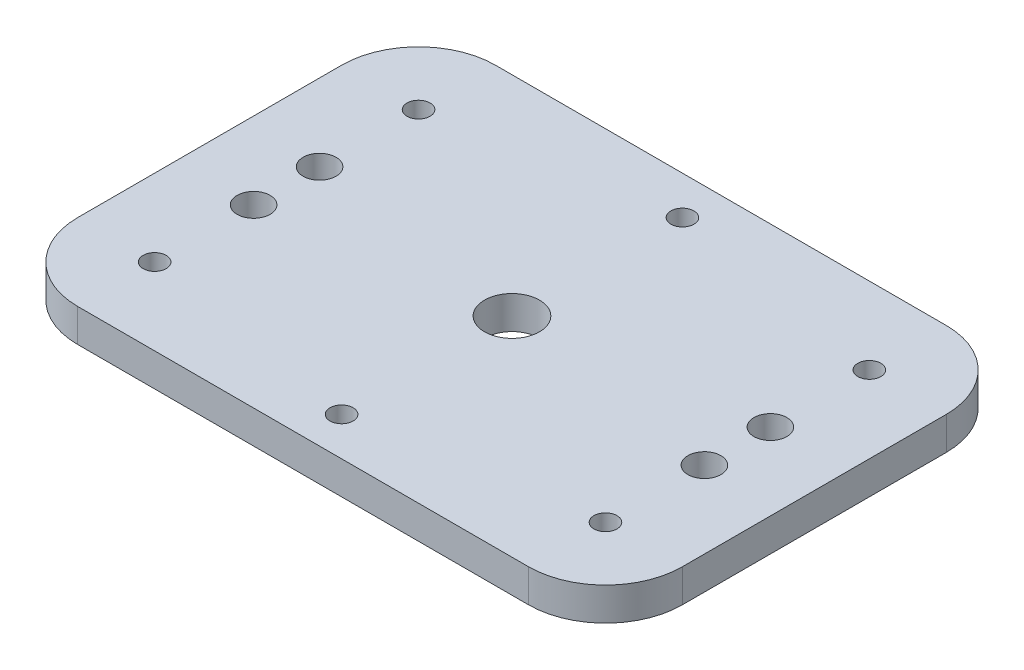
ISO-10303-21;
HEADER;
FILE_DESCRIPTION(('STEP AP214'),'2;1');
FILE_NAME('part.step','',(''),(''),'','','');
FILE_SCHEMA(('AUTOMOTIVE_DESIGN { 1 0 10303 214 1 1 1 1 }'));
ENDSEC;
DATA;
#1=APPLICATION_CONTEXT('core data for automotive mechanical design processes');
#2=APPLICATION_PROTOCOL_DEFINITION('international standard','automotive_design',2000,#1);
#3=PRODUCT_CONTEXT('',#1,'mechanical');
#4=PRODUCT('Part','Part','',(#3));
#5=PRODUCT_RELATED_PRODUCT_CATEGORY('part','',(#4));
#6=PRODUCT_DEFINITION_FORMATION('','',#4);
#7=PRODUCT_DEFINITION_CONTEXT('part definition',#1,'design');
#8=PRODUCT_DEFINITION('design','',#6,#7);
#9=PRODUCT_DEFINITION_SHAPE('','',#8);
#10=(LENGTH_UNIT() NAMED_UNIT(*) SI_UNIT(.MILLI.,.METRE.));
#11=(NAMED_UNIT(*) PLANE_ANGLE_UNIT() SI_UNIT($,.RADIAN.));
#12=(NAMED_UNIT(*) SI_UNIT($,.STERADIAN.) SOLID_ANGLE_UNIT());
#13=UNCERTAINTY_MEASURE_WITH_UNIT(LENGTH_MEASURE(1.E-05),#10,'distance_accuracy_value','');
#14=(GEOMETRIC_REPRESENTATION_CONTEXT(3) GLOBAL_UNCERTAINTY_ASSIGNED_CONTEXT((#13)) GLOBAL_UNIT_ASSIGNED_CONTEXT((#10,
#11,#12)) REPRESENTATION_CONTEXT('',''));
#15=CARTESIAN_POINT('',(0.,0.,0.));
#16=DIRECTION('',(0.,0.,1.));
#17=DIRECTION('',(1.,0.,0.));
#18=AXIS2_PLACEMENT_3D('',#15,#16,#17);
#19=CARTESIAN_POINT('',(96.,6.,-62.));
#20=DIRECTION('',(0.,1.,0.));
#21=DIRECTION('',(0.,0.,1.));
#22=AXIS2_PLACEMENT_3D('',#19,#20,#21);
#23=PLANE('',#22);
#24=CARTESIAN_POINT('',(14.,6.,-62.));
#25=DIRECTION('',(0.,1.,0.));
#26=DIRECTION('',(0.,0.,1.));
#27=AXIS2_PLACEMENT_3D('',#24,#25,#26);
#28=CIRCLE('',#27,2.09999999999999);
#29=CARTESIAN_POINT('',(14.,6.,-59.9));
#30=VERTEX_POINT('',#29);
#31=EDGE_CURVE('E239',#30,#30,#28,.T.);
#32=ORIENTED_EDGE('',*,*,#31,.F.);
#33=EDGE_LOOP('',(#32));
#34=FACE_BOUND('',#33,.T.);
#35=CARTESIAN_POINT('',(55.,6.,-69.));
#36=DIRECTION('',(0.,1.,0.));
#37=DIRECTION('',(0.,0.,1.));
#38=AXIS2_PLACEMENT_3D('',#35,#36,#37);
#39=CIRCLE('',#38,2.09999999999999);
#40=CARTESIAN_POINT('',(55.,6.,-66.9));
#41=VERTEX_POINT('',#40);
#42=EDGE_CURVE('E233',#41,#41,#39,.T.);
#43=ORIENTED_EDGE('',*,*,#42,.F.);
#44=EDGE_LOOP('',(#43));
#45=FACE_BOUND('',#44,.T.);
#46=CARTESIAN_POINT('',(96.,6.,-62.));
#47=DIRECTION('',(0.,1.,0.));
#48=DIRECTION('',(0.,0.,1.));
#49=AXIS2_PLACEMENT_3D('',#46,#47,#48);
#50=CIRCLE('',#49,2.09999999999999);
#51=CARTESIAN_POINT('',(96.,6.,-59.9));
#52=VERTEX_POINT('',#51);
#53=EDGE_CURVE('E227',#52,#52,#50,.T.);
#54=ORIENTED_EDGE('',*,*,#53,.F.);
#55=EDGE_LOOP('',(#54));
#56=FACE_BOUND('',#55,.T.);
#57=CARTESIAN_POINT('',(96.,6.,-14.));
#58=DIRECTION('',(0.,1.,0.));
#59=DIRECTION('',(0.,0.,1.));
#60=AXIS2_PLACEMENT_3D('',#57,#58,#59);
#61=CIRCLE('',#60,2.09999999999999);
#62=CARTESIAN_POINT('',(96.,6.,-11.9));
#63=VERTEX_POINT('',#62);
#64=EDGE_CURVE('E221',#63,#63,#61,.T.);
#65=ORIENTED_EDGE('',*,*,#64,.F.);
#66=EDGE_LOOP('',(#65));
#67=FACE_BOUND('',#66,.T.);
#68=CARTESIAN_POINT('',(55.,6.,-7.));
#69=DIRECTION('',(0.,1.,0.));
#70=DIRECTION('',(0.,0.,1.));
#71=AXIS2_PLACEMENT_3D('',#68,#69,#70);
#72=CIRCLE('',#71,2.09999999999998);
#73=CARTESIAN_POINT('',(55.,6.,-4.90000000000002));
#74=VERTEX_POINT('',#73);
#75=EDGE_CURVE('E215',#74,#74,#72,.T.);
#76=ORIENTED_EDGE('',*,*,#75,.F.);
#77=EDGE_LOOP('',(#76));
#78=FACE_BOUND('',#77,.T.);
#79=CARTESIAN_POINT('',(14.,6.,-14.));
#80=DIRECTION('',(0.,1.,0.));
#81=DIRECTION('',(0.,0.,1.));
#82=AXIS2_PLACEMENT_3D('',#79,#80,#81);
#83=CIRCLE('',#82,2.09999999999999);
#84=CARTESIAN_POINT('',(14.,6.,-11.9));
#85=VERTEX_POINT('',#84);
#86=EDGE_CURVE('E209',#85,#85,#83,.T.);
#87=ORIENTED_EDGE('',*,*,#86,.F.);
#88=EDGE_LOOP('',(#87));
#89=FACE_BOUND('',#88,.T.);
#90=CARTESIAN_POINT('',(96.,6.,-44.));
#91=DIRECTION('',(0.,1.,0.));
#92=DIRECTION('',(0.,0.,1.));
#93=AXIS2_PLACEMENT_3D('',#90,#91,#92);
#94=CIRCLE('',#93,3.00000000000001);
#95=CARTESIAN_POINT('',(96.,6.,-41.));
#96=VERTEX_POINT('',#95);
#97=EDGE_CURVE('E192',#96,#96,#94,.T.);
#98=ORIENTED_EDGE('',*,*,#97,.F.);
#99=EDGE_LOOP('',(#98));
#100=FACE_BOUND('',#99,.T.);
#101=CARTESIAN_POINT('',(14.,6.,-44.));
#102=DIRECTION('',(0.,1.,0.));
#103=DIRECTION('',(0.,0.,1.));
#104=AXIS2_PLACEMENT_3D('',#101,#102,#103);
#105=CIRCLE('',#104,3.);
#106=CARTESIAN_POINT('',(14.,6.,-41.));
#107=VERTEX_POINT('',#106);
#108=EDGE_CURVE('E180',#107,#107,#105,.T.);
#109=ORIENTED_EDGE('',*,*,#108,.F.);
#110=EDGE_LOOP('',(#109));
#111=FACE_BOUND('',#110,.T.);
#112=CARTESIAN_POINT('',(96.,6.,-62.));
#113=DIRECTION('',(0.,1.,0.));
#114=DIRECTION('',(0.,0.,1.));
#115=AXIS2_PLACEMENT_3D('',#112,#113,#114);
#116=CIRCLE('',#115,14.);
#117=CARTESIAN_POINT('',(110.,6.,-62.));
#118=VERTEX_POINT('',#117);
#119=CARTESIAN_POINT('',(96.,6.,-76.));
#120=VERTEX_POINT('',#119);
#121=EDGE_CURVE('E143',#118,#120,#116,.T.);
#122=ORIENTED_EDGE('',*,*,#121,.T.);
#123=DIRECTION('',(-1.,0.,0.));
#124=VECTOR('',#123,1.);
#125=CARTESIAN_POINT('',(14.,6.,-76.));
#126=LINE('',#125,#124);
#127=CARTESIAN_POINT('',(14.,6.,-76.));
#128=VERTEX_POINT('',#127);
#129=EDGE_CURVE('E91',#120,#128,#126,.T.);
#130=ORIENTED_EDGE('',*,*,#129,.T.);
#131=CARTESIAN_POINT('',(14.,6.,-62.));
#132=DIRECTION('',(0.,1.,0.));
#133=DIRECTION('',(0.,0.,-1.));
#134=AXIS2_PLACEMENT_3D('',#131,#132,#133);
#135=CIRCLE('',#134,14.);
#136=CARTESIAN_POINT('',(0.,6.,-62.));
#137=VERTEX_POINT('',#136);
#138=EDGE_CURVE('E158',#128,#137,#135,.T.);
#139=ORIENTED_EDGE('',*,*,#138,.T.);
#140=DIRECTION('',(0.,0.,1.));
#141=VECTOR('',#140,1.);
#142=CARTESIAN_POINT('',(0.,6.,-14.));
#143=LINE('',#142,#141);
#144=CARTESIAN_POINT('',(0.,6.,-14.));
#145=VERTEX_POINT('',#144);
#146=EDGE_CURVE('E171',#137,#145,#143,.T.);
#147=ORIENTED_EDGE('',*,*,#146,.T.);
#148=CARTESIAN_POINT('',(14.,6.,-14.));
#149=DIRECTION('',(0.,1.,0.));
#150=DIRECTION('',(0.,0.,1.));
#151=AXIS2_PLACEMENT_3D('',#148,#149,#150);
#152=CIRCLE('',#151,14.);
#153=CARTESIAN_POINT('',(14.,6.,0.));
#154=VERTEX_POINT('',#153);
#155=EDGE_CURVE('E110',#145,#154,#152,.T.);
#156=ORIENTED_EDGE('',*,*,#155,.T.);
#157=DIRECTION('',(1.,0.,0.));
#158=VECTOR('',#157,1.);
#159=CARTESIAN_POINT('',(14.,6.,0.));
#160=LINE('',#159,#158);
#161=CARTESIAN_POINT('',(96.,6.,0.));
#162=VERTEX_POINT('',#161);
#163=EDGE_CURVE('E104',#154,#162,#160,.T.);
#164=ORIENTED_EDGE('',*,*,#163,.T.);
#165=CARTESIAN_POINT('',(96.,6.,-14.));
#166=DIRECTION('',(0.,1.,0.));
#167=DIRECTION('',(0.,0.,1.));
#168=AXIS2_PLACEMENT_3D('',#165,#166,#167);
#169=CIRCLE('',#168,14.);
#170=CARTESIAN_POINT('',(110.,6.,-14.));
#171=VERTEX_POINT('',#170);
#172=EDGE_CURVE('E108',#162,#171,#169,.T.);
#173=ORIENTED_EDGE('',*,*,#172,.T.);
#174=DIRECTION('',(0.,0.,-1.));
#175=VECTOR('',#174,1.);
#176=CARTESIAN_POINT('',(110.,6.,-14.));
#177=LINE('',#176,#175);
#178=EDGE_CURVE('E48',#171,#118,#177,.T.);
#179=ORIENTED_EDGE('',*,*,#178,.T.);
#180=EDGE_LOOP('',(#122,#130,#139,#147,#156,#164,#173,#179));
#181=FACE_BOUND('',#180,.T.);
#182=CARTESIAN_POINT('',(55.,6.,-38.));
#183=DIRECTION('',(0.,1.,0.));
#184=DIRECTION('',(0.,0.,1.));
#185=AXIS2_PLACEMENT_3D('',#182,#183,#184);
#186=CIRCLE('',#185,5.);
#187=CARTESIAN_POINT('',(55.,6.,-33.));
#188=VERTEX_POINT('',#187);
#189=EDGE_CURVE('E132',#188,#188,#186,.T.);
#190=ORIENTED_EDGE('',*,*,#189,.F.);
#191=EDGE_LOOP('',(#190));
#192=FACE_BOUND('',#191,.T.);
#193=CARTESIAN_POINT('',(14.,6.,-32.));
#194=DIRECTION('',(0.,1.,0.));
#195=DIRECTION('',(0.,0.,1.));
#196=AXIS2_PLACEMENT_3D('',#193,#194,#195);
#197=CIRCLE('',#196,3.);
#198=CARTESIAN_POINT('',(14.,6.,-29.));
#199=VERTEX_POINT('',#198);
#200=EDGE_CURVE('E186',#199,#199,#197,.T.);
#201=ORIENTED_EDGE('',*,*,#200,.F.);
#202=EDGE_LOOP('',(#201));
#203=FACE_BOUND('',#202,.T.);
#204=CARTESIAN_POINT('',(96.,6.,-32.));
#205=DIRECTION('',(0.,1.,0.));
#206=DIRECTION('',(0.,0.,1.));
#207=AXIS2_PLACEMENT_3D('',#204,#205,#206);
#208=CIRCLE('',#207,3.00000000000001);
#209=CARTESIAN_POINT('',(96.,6.,-29.));
#210=VERTEX_POINT('',#209);
#211=EDGE_CURVE('E198',#210,#210,#208,.T.);
#212=ORIENTED_EDGE('',*,*,#211,.F.);
#213=EDGE_LOOP('',(#212));
#214=FACE_BOUND('',#213,.T.);
#215=ADVANCED_FACE('F31',(#34,#45,#56,#67,#78,#89,#100,#111,#181,#192,#203,#214),#23,.T.);
#216=CARTESIAN_POINT('',(96.,0.,-62.));
#217=DIRECTION('',(0.,1.,0.));
#218=DIRECTION('',(0.,0.,1.));
#219=AXIS2_PLACEMENT_3D('',#216,#217,#218);
#220=PLANE('',#219);
#221=CARTESIAN_POINT('',(14.,0.,-62.));
#222=DIRECTION('',(0.,1.,0.));
#223=DIRECTION('',(0.,0.,1.));
#224=AXIS2_PLACEMENT_3D('',#221,#222,#223);
#225=CIRCLE('',#224,2.1);
#226=CARTESIAN_POINT('',(14.,0.,-59.9));
#227=VERTEX_POINT('',#226);
#228=EDGE_CURVE('E236',#227,#227,#225,.T.);
#229=ORIENTED_EDGE('',*,*,#228,.T.);
#230=EDGE_LOOP('',(#229));
#231=FACE_BOUND('',#230,.T.);
#232=CARTESIAN_POINT('',(55.,0.,-69.));
#233=DIRECTION('',(0.,1.,0.));
#234=DIRECTION('',(0.,0.,1.));
#235=AXIS2_PLACEMENT_3D('',#232,#233,#234);
#236=CIRCLE('',#235,2.1);
#237=CARTESIAN_POINT('',(55.,0.,-66.9));
#238=VERTEX_POINT('',#237);
#239=EDGE_CURVE('E230',#238,#238,#236,.T.);
#240=ORIENTED_EDGE('',*,*,#239,.T.);
#241=EDGE_LOOP('',(#240));
#242=FACE_BOUND('',#241,.T.);
#243=CARTESIAN_POINT('',(96.,0.,-62.));
#244=DIRECTION('',(0.,1.,0.));
#245=DIRECTION('',(0.,0.,1.));
#246=AXIS2_PLACEMENT_3D('',#243,#244,#245);
#247=CIRCLE('',#246,2.1);
#248=CARTESIAN_POINT('',(96.,0.,-59.9));
#249=VERTEX_POINT('',#248);
#250=EDGE_CURVE('E224',#249,#249,#247,.T.);
#251=ORIENTED_EDGE('',*,*,#250,.T.);
#252=EDGE_LOOP('',(#251));
#253=FACE_BOUND('',#252,.T.);
#254=CARTESIAN_POINT('',(96.,0.,-14.));
#255=DIRECTION('',(0.,1.,0.));
#256=DIRECTION('',(0.,0.,1.));
#257=AXIS2_PLACEMENT_3D('',#254,#255,#256);
#258=CIRCLE('',#257,2.1);
#259=CARTESIAN_POINT('',(96.,0.,-11.9));
#260=VERTEX_POINT('',#259);
#261=EDGE_CURVE('E218',#260,#260,#258,.T.);
#262=ORIENTED_EDGE('',*,*,#261,.T.);
#263=EDGE_LOOP('',(#262));
#264=FACE_BOUND('',#263,.T.);
#265=CARTESIAN_POINT('',(55.,0.,-7.));
#266=DIRECTION('',(0.,1.,0.));
#267=DIRECTION('',(0.,0.,1.));
#268=AXIS2_PLACEMENT_3D('',#265,#266,#267);
#269=CIRCLE('',#268,2.1);
#270=CARTESIAN_POINT('',(55.,0.,-4.9));
#271=VERTEX_POINT('',#270);
#272=EDGE_CURVE('E212',#271,#271,#269,.T.);
#273=ORIENTED_EDGE('',*,*,#272,.T.);
#274=EDGE_LOOP('',(#273));
#275=FACE_BOUND('',#274,.T.);
#276=CARTESIAN_POINT('',(14.,0.,-14.));
#277=DIRECTION('',(0.,1.,0.));
#278=DIRECTION('',(0.,0.,1.));
#279=AXIS2_PLACEMENT_3D('',#276,#277,#278);
#280=CIRCLE('',#279,2.1);
#281=CARTESIAN_POINT('',(14.,0.,-11.9));
#282=VERTEX_POINT('',#281);
#283=EDGE_CURVE('E204',#282,#282,#280,.T.);
#284=ORIENTED_EDGE('',*,*,#283,.T.);
#285=EDGE_LOOP('',(#284));
#286=FACE_BOUND('',#285,.T.);
#287=CARTESIAN_POINT('',(96.,0.,-44.));
#288=DIRECTION('',(0.,1.,0.));
#289=DIRECTION('',(0.,0.,1.));
#290=AXIS2_PLACEMENT_3D('',#287,#288,#289);
#291=CIRCLE('',#290,3.00000000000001);
#292=CARTESIAN_POINT('',(96.,0.,-41.));
#293=VERTEX_POINT('',#292);
#294=EDGE_CURVE('E195',#293,#293,#291,.T.);
#295=ORIENTED_EDGE('',*,*,#294,.T.);
#296=EDGE_LOOP('',(#295));
#297=FACE_BOUND('',#296,.T.);
#298=CARTESIAN_POINT('',(14.,0.,-44.));
#299=DIRECTION('',(0.,1.,0.));
#300=DIRECTION('',(0.,0.,1.));
#301=AXIS2_PLACEMENT_3D('',#298,#299,#300);
#302=CIRCLE('',#301,3.);
#303=CARTESIAN_POINT('',(14.,0.,-41.));
#304=VERTEX_POINT('',#303);
#305=EDGE_CURVE('E183',#304,#304,#302,.T.);
#306=ORIENTED_EDGE('',*,*,#305,.T.);
#307=EDGE_LOOP('',(#306));
#308=FACE_BOUND('',#307,.T.);
#309=CARTESIAN_POINT('',(96.,0.,-62.));
#310=DIRECTION('',(0.,1.,0.));
#311=DIRECTION('',(0.,0.,1.));
#312=AXIS2_PLACEMENT_3D('',#309,#310,#311);
#313=CIRCLE('',#312,14.);
#314=CARTESIAN_POINT('',(110.,0.,-62.));
#315=VERTEX_POINT('',#314);
#316=CARTESIAN_POINT('',(96.,0.,-76.));
#317=VERTEX_POINT('',#316);
#318=EDGE_CURVE('E128',#315,#317,#313,.T.);
#319=ORIENTED_EDGE('',*,*,#318,.F.);
#320=DIRECTION('',(0.,0.,-1.));
#321=VECTOR('',#320,1.);
#322=CARTESIAN_POINT('',(110.,0.,-14.));
#323=LINE('',#322,#321);
#324=CARTESIAN_POINT('',(110.,0.,-14.));
#325=VERTEX_POINT('',#324);
#326=EDGE_CURVE('E83',#325,#315,#323,.T.);
#327=ORIENTED_EDGE('',*,*,#326,.F.);
#328=CARTESIAN_POINT('',(96.,0.,-14.));
#329=DIRECTION('',(0.,1.,0.));
#330=DIRECTION('',(0.,0.,1.));
#331=AXIS2_PLACEMENT_3D('',#328,#329,#330);
#332=CIRCLE('',#331,14.);
#333=CARTESIAN_POINT('',(96.,0.,0.));
#334=VERTEX_POINT('',#333);
#335=EDGE_CURVE('E77',#334,#325,#332,.T.);
#336=ORIENTED_EDGE('',*,*,#335,.F.);
#337=DIRECTION('',(1.,0.,0.));
#338=VECTOR('',#337,1.);
#339=CARTESIAN_POINT('',(14.,0.,0.));
#340=LINE('',#339,#338);
#341=CARTESIAN_POINT('',(14.,0.,0.));
#342=VERTEX_POINT('',#341);
#343=EDGE_CURVE('E118',#342,#334,#340,.T.);
#344=ORIENTED_EDGE('',*,*,#343,.F.);
#345=CARTESIAN_POINT('',(14.,0.,-14.));
#346=DIRECTION('',(0.,1.,0.));
#347=DIRECTION('',(0.,0.,1.));
#348=AXIS2_PLACEMENT_3D('',#345,#346,#347);
#349=CIRCLE('',#348,14.);
#350=CARTESIAN_POINT('',(0.,0.,-14.));
#351=VERTEX_POINT('',#350);
#352=EDGE_CURVE('E138',#351,#342,#349,.T.);
#353=ORIENTED_EDGE('',*,*,#352,.F.);
#354=DIRECTION('',(0.,0.,1.));
#355=VECTOR('',#354,1.);
#356=CARTESIAN_POINT('',(0.,0.,-14.));
#357=LINE('',#356,#355);
#358=CARTESIAN_POINT('',(0.,0.,-62.));
#359=VERTEX_POINT('',#358);
#360=EDGE_CURVE('E136',#359,#351,#357,.T.);
#361=ORIENTED_EDGE('',*,*,#360,.F.);
#362=CARTESIAN_POINT('',(14.,0.,-62.));
#363=DIRECTION('',(0.,1.,0.));
#364=DIRECTION('',(0.,0.,-1.));
#365=AXIS2_PLACEMENT_3D('',#362,#363,#364);
#366=CIRCLE('',#365,14.);
#367=CARTESIAN_POINT('',(14.,0.,-76.));
#368=VERTEX_POINT('',#367);
#369=EDGE_CURVE('E134',#368,#359,#366,.T.);
#370=ORIENTED_EDGE('',*,*,#369,.F.);
#371=DIRECTION('',(-1.,0.,0.));
#372=VECTOR('',#371,1.);
#373=CARTESIAN_POINT('',(14.,0.,-76.));
#374=LINE('',#373,#372);
#375=EDGE_CURVE('E131',#317,#368,#374,.T.);
#376=ORIENTED_EDGE('',*,*,#375,.F.);
#377=EDGE_LOOP('',(#319,#327,#336,#344,#353,#361,#370,#376));
#378=FACE_BOUND('',#377,.T.);
#379=CARTESIAN_POINT('',(55.,0.,-38.));
#380=DIRECTION('',(0.,1.,0.));
#381=DIRECTION('',(0.,0.,1.));
#382=AXIS2_PLACEMENT_3D('',#379,#380,#381);
#383=CIRCLE('',#382,5.);
#384=CARTESIAN_POINT('',(55.,0.,-33.));
#385=VERTEX_POINT('',#384);
#386=EDGE_CURVE('E177',#385,#385,#383,.T.);
#387=ORIENTED_EDGE('',*,*,#386,.T.);
#388=EDGE_LOOP('',(#387));
#389=FACE_BOUND('',#388,.T.);
#390=CARTESIAN_POINT('',(14.,0.,-32.));
#391=DIRECTION('',(0.,1.,0.));
#392=DIRECTION('',(0.,0.,1.));
#393=AXIS2_PLACEMENT_3D('',#390,#391,#392);
#394=CIRCLE('',#393,3.);
#395=CARTESIAN_POINT('',(14.,0.,-29.));
#396=VERTEX_POINT('',#395);
#397=EDGE_CURVE('E189',#396,#396,#394,.T.);
#398=ORIENTED_EDGE('',*,*,#397,.T.);
#399=EDGE_LOOP('',(#398));
#400=FACE_BOUND('',#399,.T.);
#401=CARTESIAN_POINT('',(96.,0.,-32.));
#402=DIRECTION('',(0.,1.,0.));
#403=DIRECTION('',(0.,0.,1.));
#404=AXIS2_PLACEMENT_3D('',#401,#402,#403);
#405=CIRCLE('',#404,3.00000000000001);
#406=CARTESIAN_POINT('',(96.,0.,-29.));
#407=VERTEX_POINT('',#406);
#408=EDGE_CURVE('E201',#407,#407,#405,.T.);
#409=ORIENTED_EDGE('',*,*,#408,.T.);
#410=EDGE_LOOP('',(#409));
#411=FACE_BOUND('',#410,.T.);
#412=ADVANCED_FACE('F162',(#231,#242,#253,#264,#275,#286,#297,#308,#378,#389,#400,#411),#220,.F.);
#413=CARTESIAN_POINT('',(96.,6.,-62.));
#414=DIRECTION('',(0.,-1.,0.));
#415=DIRECTION('',(0.,0.,-1.));
#416=AXIS2_PLACEMENT_3D('',#413,#414,#415);
#417=CYLINDRICAL_SURFACE('',#416,14.);
#418=ORIENTED_EDGE('',*,*,#318,.T.);
#419=DIRECTION('',(0.,-1.,0.));
#420=VECTOR('',#419,1.);
#421=CARTESIAN_POINT('',(96.,6.,-76.));
#422=LINE('',#421,#420);
#423=EDGE_CURVE('E11',#120,#317,#422,.T.);
#424=ORIENTED_EDGE('',*,*,#423,.F.);
#425=ORIENTED_EDGE('',*,*,#121,.F.);
#426=DIRECTION('',(0.,-1.,0.));
#427=VECTOR('',#426,1.);
#428=CARTESIAN_POINT('',(110.,6.,-62.));
#429=LINE('',#428,#427);
#430=EDGE_CURVE('E124',#118,#315,#429,.T.);
#431=ORIENTED_EDGE('',*,*,#430,.T.);
#432=EDGE_LOOP('',(#418,#424,#425,#431));
#433=FACE_BOUND('',#432,.T.);
#434=ADVANCED_FACE('F33',(#433),#417,.T.);
#435=CARTESIAN_POINT('',(14.,6.,-76.));
#436=DIRECTION('',(0.,0.,1.));
#437=DIRECTION('',(1.,0.,0.));
#438=AXIS2_PLACEMENT_3D('',#435,#436,#437);
#439=PLANE('',#438);
#440=ORIENTED_EDGE('',*,*,#375,.T.);
#441=DIRECTION('',(0.,-1.,0.));
#442=VECTOR('',#441,1.);
#443=CARTESIAN_POINT('',(14.,6.,-76.));
#444=LINE('',#443,#442);
#445=EDGE_CURVE('E40',#128,#368,#444,.T.);
#446=ORIENTED_EDGE('',*,*,#445,.F.);
#447=ORIENTED_EDGE('',*,*,#129,.F.);
#448=ORIENTED_EDGE('',*,*,#423,.T.);
#449=EDGE_LOOP('',(#440,#446,#447,#448));
#450=FACE_BOUND('',#449,.T.);
#451=ADVANCED_FACE('F276',(#450),#439,.F.);
#452=CARTESIAN_POINT('',(14.,6.,-62.));
#453=DIRECTION('',(0.,-1.,0.));
#454=DIRECTION('',(0.,0.,-1.));
#455=AXIS2_PLACEMENT_3D('',#452,#453,#454);
#456=CYLINDRICAL_SURFACE('',#455,14.);
#457=ORIENTED_EDGE('',*,*,#369,.T.);
#458=DIRECTION('',(0.,-1.,0.));
#459=VECTOR('',#458,1.);
#460=CARTESIAN_POINT('',(0.,6.,-62.));
#461=LINE('',#460,#459);
#462=EDGE_CURVE('E150',#137,#359,#461,.T.);
#463=ORIENTED_EDGE('',*,*,#462,.F.);
#464=ORIENTED_EDGE('',*,*,#138,.F.);
#465=ORIENTED_EDGE('',*,*,#445,.T.);
#466=EDGE_LOOP('',(#457,#463,#464,#465));
#467=FACE_BOUND('',#466,.T.);
#468=ADVANCED_FACE('F156',(#467),#456,.T.);
#469=CARTESIAN_POINT('',(0.,6.,-14.));
#470=DIRECTION('',(1.,0.,0.));
#471=DIRECTION('',(0.,0.,-1.));
#472=AXIS2_PLACEMENT_3D('',#469,#470,#471);
#473=PLANE('',#472);
#474=ORIENTED_EDGE('',*,*,#360,.T.);
#475=DIRECTION('',(0.,-1.,0.));
#476=VECTOR('',#475,1.);
#477=CARTESIAN_POINT('',(0.,6.,-14.));
#478=LINE('',#477,#476);
#479=EDGE_CURVE('E147',#145,#351,#478,.T.);
#480=ORIENTED_EDGE('',*,*,#479,.F.);
#481=ORIENTED_EDGE('',*,*,#146,.F.);
#482=ORIENTED_EDGE('',*,*,#462,.T.);
#483=EDGE_LOOP('',(#474,#480,#481,#482));
#484=FACE_BOUND('',#483,.T.);
#485=ADVANCED_FACE('F167',(#484),#473,.F.);
#486=CARTESIAN_POINT('',(14.,6.,-14.));
#487=DIRECTION('',(0.,-1.,0.));
#488=DIRECTION('',(0.,0.,-1.));
#489=AXIS2_PLACEMENT_3D('',#486,#487,#488);
#490=CYLINDRICAL_SURFACE('',#489,14.);
#491=ORIENTED_EDGE('',*,*,#352,.T.);
#492=DIRECTION('',(0.,-1.,0.));
#493=VECTOR('',#492,1.);
#494=CARTESIAN_POINT('',(14.,6.,0.));
#495=LINE('',#494,#493);
#496=EDGE_CURVE('E119',#154,#342,#495,.T.);
#497=ORIENTED_EDGE('',*,*,#496,.F.);
#498=ORIENTED_EDGE('',*,*,#155,.F.);
#499=ORIENTED_EDGE('',*,*,#479,.T.);
#500=EDGE_LOOP('',(#491,#497,#498,#499));
#501=FACE_BOUND('',#500,.T.);
#502=ADVANCED_FACE('F170',(#501),#490,.T.);
#503=CARTESIAN_POINT('',(14.,6.,0.));
#504=DIRECTION('',(0.,0.,-1.));
#505=DIRECTION('',(-1.,0.,0.));
#506=AXIS2_PLACEMENT_3D('',#503,#504,#505);
#507=PLANE('',#506);
#508=ORIENTED_EDGE('',*,*,#343,.T.);
#509=DIRECTION('',(0.,-1.,0.));
#510=VECTOR('',#509,1.);
#511=CARTESIAN_POINT('',(96.,6.,0.));
#512=LINE('',#511,#510);
#513=EDGE_CURVE('E115',#162,#334,#512,.T.);
#514=ORIENTED_EDGE('',*,*,#513,.F.);
#515=ORIENTED_EDGE('',*,*,#163,.F.);
#516=ORIENTED_EDGE('',*,*,#496,.T.);
#517=EDGE_LOOP('',(#508,#514,#515,#516));
#518=FACE_BOUND('',#517,.T.);
#519=ADVANCED_FACE('F116',(#518),#507,.F.);
#520=CARTESIAN_POINT('',(96.,6.,-14.));
#521=DIRECTION('',(0.,-1.,0.));
#522=DIRECTION('',(0.,0.,-1.));
#523=AXIS2_PLACEMENT_3D('',#520,#521,#522);
#524=CYLINDRICAL_SURFACE('',#523,14.);
#525=ORIENTED_EDGE('',*,*,#335,.T.);
#526=DIRECTION('',(0.,-1.,0.));
#527=VECTOR('',#526,1.);
#528=CARTESIAN_POINT('',(110.,6.,-14.));
#529=LINE('',#528,#527);
#530=EDGE_CURVE('E120',#171,#325,#529,.T.);
#531=ORIENTED_EDGE('',*,*,#530,.F.);
#532=ORIENTED_EDGE('',*,*,#172,.F.);
#533=ORIENTED_EDGE('',*,*,#513,.T.);
#534=EDGE_LOOP('',(#525,#531,#532,#533));
#535=FACE_BOUND('',#534,.T.);
#536=ADVANCED_FACE('F122',(#535),#524,.T.);
#537=CARTESIAN_POINT('',(110.,6.,-14.));
#538=DIRECTION('',(-1.,0.,0.));
#539=DIRECTION('',(0.,0.,1.));
#540=AXIS2_PLACEMENT_3D('',#537,#538,#539);
#541=PLANE('',#540);
#542=ORIENTED_EDGE('',*,*,#326,.T.);
#543=ORIENTED_EDGE('',*,*,#430,.F.);
#544=ORIENTED_EDGE('',*,*,#178,.F.);
#545=ORIENTED_EDGE('',*,*,#530,.T.);
#546=EDGE_LOOP('',(#542,#543,#544,#545));
#547=FACE_BOUND('',#546,.T.);
#548=ADVANCED_FACE('F281',(#547),#541,.F.);
#549=CARTESIAN_POINT('',(55.,6.,-38.));
#550=DIRECTION('',(0.,-1.,0.));
#551=DIRECTION('',(0.,0.,-1.));
#552=AXIS2_PLACEMENT_3D('',#549,#550,#551);
#553=CYLINDRICAL_SURFACE('',#552,5.);
#554=ORIENTED_EDGE('',*,*,#189,.T.);
#555=EDGE_LOOP('',(#554));
#556=FACE_BOUND('',#555,.T.);
#557=ORIENTED_EDGE('',*,*,#386,.F.);
#558=EDGE_LOOP('',(#557));
#559=FACE_BOUND('',#558,.T.);
#560=ADVANCED_FACE('F266',(#556,#559),#553,.F.);
#561=CARTESIAN_POINT('',(14.,6.,-44.));
#562=DIRECTION('',(0.,-1.,0.));
#563=DIRECTION('',(0.,0.,-1.));
#564=AXIS2_PLACEMENT_3D('',#561,#562,#563);
#565=CYLINDRICAL_SURFACE('',#564,3.);
#566=ORIENTED_EDGE('',*,*,#108,.T.);
#567=EDGE_LOOP('',(#566));
#568=FACE_BOUND('',#567,.T.);
#569=ORIENTED_EDGE('',*,*,#305,.F.);
#570=EDGE_LOOP('',(#569));
#571=FACE_BOUND('',#570,.T.);
#572=ADVANCED_FACE('F262',(#568,#571),#565,.F.);
#573=CARTESIAN_POINT('',(14.,6.,-32.));
#574=DIRECTION('',(0.,-1.,0.));
#575=DIRECTION('',(0.,0.,-1.));
#576=AXIS2_PLACEMENT_3D('',#573,#574,#575);
#577=CYLINDRICAL_SURFACE('',#576,3.);
#578=ORIENTED_EDGE('',*,*,#200,.T.);
#579=EDGE_LOOP('',(#578));
#580=FACE_BOUND('',#579,.T.);
#581=ORIENTED_EDGE('',*,*,#397,.F.);
#582=EDGE_LOOP('',(#581));
#583=FACE_BOUND('',#582,.T.);
#584=ADVANCED_FACE('F265',(#580,#583),#577,.F.);
#585=CARTESIAN_POINT('',(96.,6.,-44.));
#586=DIRECTION('',(0.,-1.,0.));
#587=DIRECTION('',(0.,0.,-1.));
#588=AXIS2_PLACEMENT_3D('',#585,#586,#587);
#589=CYLINDRICAL_SURFACE('',#588,3.00000000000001);
#590=ORIENTED_EDGE('',*,*,#97,.T.);
#591=EDGE_LOOP('',(#590));
#592=FACE_BOUND('',#591,.T.);
#593=ORIENTED_EDGE('',*,*,#294,.F.);
#594=EDGE_LOOP('',(#593));
#595=FACE_BOUND('',#594,.T.);
#596=ADVANCED_FACE('F340',(#592,#595),#589,.F.);
#597=CARTESIAN_POINT('',(96.,6.,-32.));
#598=DIRECTION('',(0.,-1.,0.));
#599=DIRECTION('',(0.,0.,-1.));
#600=AXIS2_PLACEMENT_3D('',#597,#598,#599);
#601=CYLINDRICAL_SURFACE('',#600,3.00000000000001);
#602=ORIENTED_EDGE('',*,*,#211,.T.);
#603=EDGE_LOOP('',(#602));
#604=FACE_BOUND('',#603,.T.);
#605=ORIENTED_EDGE('',*,*,#408,.F.);
#606=EDGE_LOOP('',(#605));
#607=FACE_BOUND('',#606,.T.);
#608=ADVANCED_FACE('F348',(#604,#607),#601,.F.);
#609=CARTESIAN_POINT('',(14.,6.,-14.));
#610=DIRECTION('',(0.,1.,0.));
#611=DIRECTION('',(0.,0.,1.));
#612=AXIS2_PLACEMENT_3D('',#609,#610,#611);
#613=CYLINDRICAL_SURFACE('',#612,2.09999999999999);
#614=ORIENTED_EDGE('',*,*,#283,.F.);
#615=EDGE_LOOP('',(#614));
#616=FACE_BOUND('',#615,.T.);
#617=ORIENTED_EDGE('',*,*,#86,.T.);
#618=EDGE_LOOP('',(#617));
#619=FACE_BOUND('',#618,.T.);
#620=ADVANCED_FACE('F356',(#616,#619),#613,.F.);
#621=CARTESIAN_POINT('',(55.,6.,-7.));
#622=DIRECTION('',(0.,1.,0.));
#623=DIRECTION('',(0.,0.,1.));
#624=AXIS2_PLACEMENT_3D('',#621,#622,#623);
#625=CYLINDRICAL_SURFACE('',#624,2.09999999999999);
#626=ORIENTED_EDGE('',*,*,#272,.F.);
#627=EDGE_LOOP('',(#626));
#628=FACE_BOUND('',#627,.T.);
#629=ORIENTED_EDGE('',*,*,#75,.T.);
#630=EDGE_LOOP('',(#629));
#631=FACE_BOUND('',#630,.T.);
#632=ADVANCED_FACE('F365',(#628,#631),#625,.F.);
#633=CARTESIAN_POINT('',(96.,6.,-14.));
#634=DIRECTION('',(0.,1.,0.));
#635=DIRECTION('',(0.,0.,1.));
#636=AXIS2_PLACEMENT_3D('',#633,#634,#635);
#637=CYLINDRICAL_SURFACE('',#636,2.1);
#638=ORIENTED_EDGE('',*,*,#261,.F.);
#639=EDGE_LOOP('',(#638));
#640=FACE_BOUND('',#639,.T.);
#641=ORIENTED_EDGE('',*,*,#64,.T.);
#642=EDGE_LOOP('',(#641));
#643=FACE_BOUND('',#642,.T.);
#644=ADVANCED_FACE('F373',(#640,#643),#637,.F.);
#645=CARTESIAN_POINT('',(96.,6.,-62.));
#646=DIRECTION('',(0.,1.,0.));
#647=DIRECTION('',(0.,0.,1.));
#648=AXIS2_PLACEMENT_3D('',#645,#646,#647);
#649=CYLINDRICAL_SURFACE('',#648,2.1);
#650=ORIENTED_EDGE('',*,*,#250,.F.);
#651=EDGE_LOOP('',(#650));
#652=FACE_BOUND('',#651,.T.);
#653=ORIENTED_EDGE('',*,*,#53,.T.);
#654=EDGE_LOOP('',(#653));
#655=FACE_BOUND('',#654,.T.);
#656=ADVANCED_FACE('F381',(#652,#655),#649,.F.);
#657=CARTESIAN_POINT('',(55.,6.,-69.));
#658=DIRECTION('',(0.,1.,0.));
#659=DIRECTION('',(0.,0.,1.));
#660=AXIS2_PLACEMENT_3D('',#657,#658,#659);
#661=CYLINDRICAL_SURFACE('',#660,2.09999999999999);
#662=ORIENTED_EDGE('',*,*,#239,.F.);
#663=EDGE_LOOP('',(#662));
#664=FACE_BOUND('',#663,.T.);
#665=ORIENTED_EDGE('',*,*,#42,.T.);
#666=EDGE_LOOP('',(#665));
#667=FACE_BOUND('',#666,.T.);
#668=ADVANCED_FACE('F389',(#664,#667),#661,.F.);
#669=CARTESIAN_POINT('',(14.,6.,-62.));
#670=DIRECTION('',(0.,1.,0.));
#671=DIRECTION('',(0.,0.,1.));
#672=AXIS2_PLACEMENT_3D('',#669,#670,#671);
#673=CYLINDRICAL_SURFACE('',#672,2.09999999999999);
#674=ORIENTED_EDGE('',*,*,#228,.F.);
#675=EDGE_LOOP('',(#674));
#676=FACE_BOUND('',#675,.T.);
#677=ORIENTED_EDGE('',*,*,#31,.T.);
#678=EDGE_LOOP('',(#677));
#679=FACE_BOUND('',#678,.T.);
#680=ADVANCED_FACE('F243',(#676,#679),#673,.F.);
#681=CLOSED_SHELL('',(#215,#412,#434,#451,#468,#485,#502,#519,#536,#548,#560,#572,#584,#596,
#608,#620,#632,#644,#656,#668,#680));
#682=MANIFOLD_SOLID_BREP('B2',#681);
#683=ADVANCED_BREP_SHAPE_REPRESENTATION('',(#18,#682),#14);
#684=SHAPE_DEFINITION_REPRESENTATION(#9,#683);
ENDSEC;
END-ISO-10303-21;
